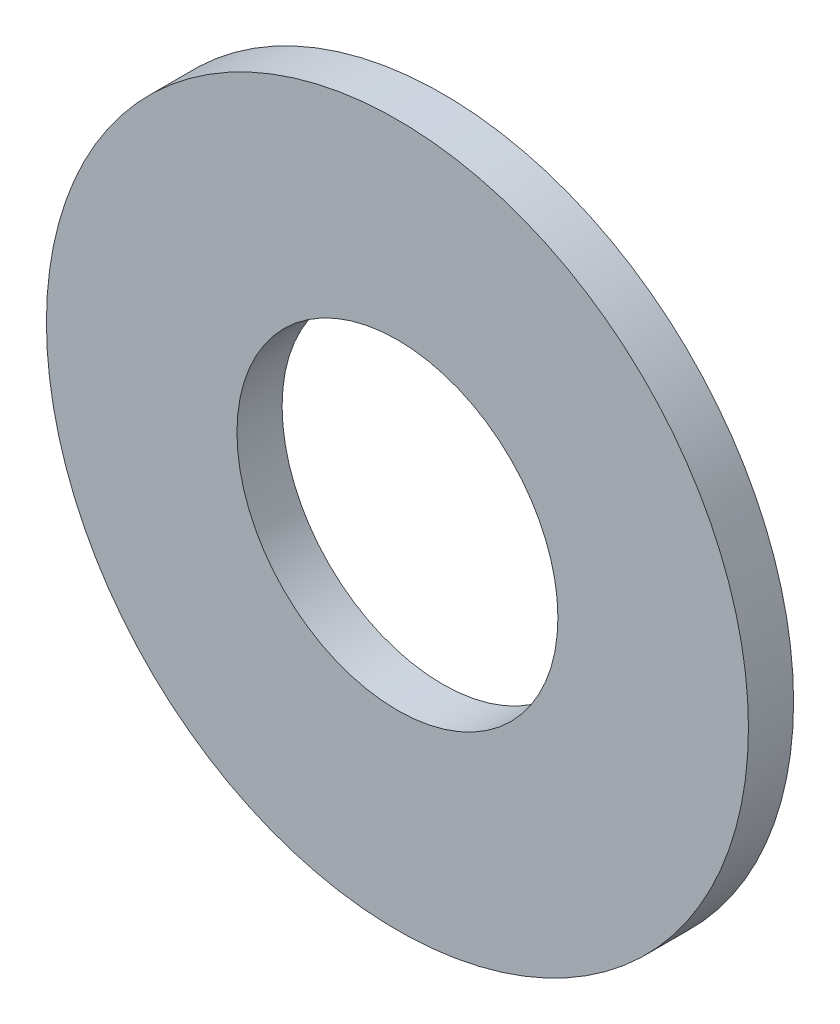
from build123d import *

# Parameters (mm, degrees)
SKETCH1_R      = 3.5
SKETCH1_R_2    = 1.6
EXTRUDE1_DEPTH = 0.45


with BuildPart() as part:
    # Sketch1 → Extrude1 (new body)
    with BuildSketch(Plane.XY):
        Circle(SKETCH1_R)
        Circle(SKETCH1_R_2, mode=Mode.SUBTRACT)
    extrude(amount=-EXTRUDE1_DEPTH)


solid = part.part
